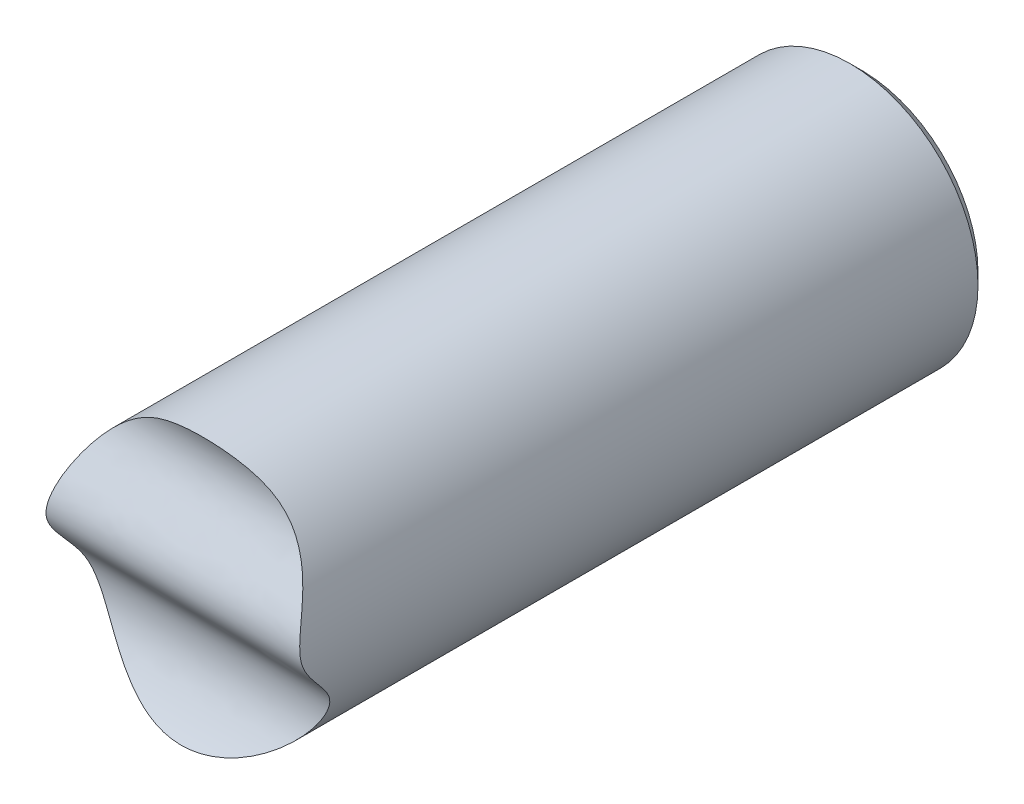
ISO-10303-21;
HEADER;
FILE_DESCRIPTION(('STEP AP214'),'2;1');
FILE_NAME('part.step','',(''),(''),'','','');
FILE_SCHEMA(('AUTOMOTIVE_DESIGN { 1 0 10303 214 1 1 1 1 }'));
ENDSEC;
DATA;
#1=APPLICATION_CONTEXT('core data for automotive mechanical design processes');
#2=APPLICATION_PROTOCOL_DEFINITION('international standard','automotive_design',2000,#1);
#3=PRODUCT_CONTEXT('',#1,'mechanical');
#4=PRODUCT('Part','Part','',(#3));
#5=PRODUCT_RELATED_PRODUCT_CATEGORY('part','',(#4));
#6=PRODUCT_DEFINITION_FORMATION('','',#4);
#7=PRODUCT_DEFINITION_CONTEXT('part definition',#1,'design');
#8=PRODUCT_DEFINITION('design','',#6,#7);
#9=PRODUCT_DEFINITION_SHAPE('','',#8);
#10=(LENGTH_UNIT() NAMED_UNIT(*) SI_UNIT(.MILLI.,.METRE.));
#11=(NAMED_UNIT(*) PLANE_ANGLE_UNIT() SI_UNIT($,.RADIAN.));
#12=(NAMED_UNIT(*) SI_UNIT($,.STERADIAN.) SOLID_ANGLE_UNIT());
#13=UNCERTAINTY_MEASURE_WITH_UNIT(LENGTH_MEASURE(1.E-05),#10,'distance_accuracy_value','');
#14=(GEOMETRIC_REPRESENTATION_CONTEXT(3) GLOBAL_UNCERTAINTY_ASSIGNED_CONTEXT((#13)) GLOBAL_UNIT_ASSIGNED_CONTEXT((#10,
#11,#12)) REPRESENTATION_CONTEXT('',''));
#15=CARTESIAN_POINT('',(0.,0.,0.));
#16=DIRECTION('',(0.,0.,1.));
#17=DIRECTION('',(1.,0.,0.));
#18=AXIS2_PLACEMENT_3D('',#15,#16,#17);
#19=CARTESIAN_POINT('',(2.11065070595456,0.,60.));
#20=DIRECTION('',(0.,0.,-1.));
#21=DIRECTION('',(-1.,0.,0.));
#22=AXIS2_PLACEMENT_3D('',#19,#20,#21);
#23=CYLINDRICAL_SURFACE('',#22,11.);
#24=CARTESIAN_POINT('',(2.11065070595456,0.,0.999999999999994));
#25=DIRECTION('',(0.,0.,1.));
#26=DIRECTION('',(1.,0.,0.));
#27=AXIS2_PLACEMENT_3D('',#24,#25,#26);
#28=CIRCLE('',#27,11.);
#29=CARTESIAN_POINT('',(13.1106507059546,0.,0.999999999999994));
#30=VERTEX_POINT('',#29);
#31=EDGE_CURVE('E54',#30,#30,#28,.T.);
#32=ORIENTED_EDGE('',*,*,#31,.T.);
#33=EDGE_LOOP('',(#32));
#34=FACE_BOUND('',#33,.T.);
#35=CARTESIAN_POINT('',(-8.88934929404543,0.,58.7075749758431));
#36=CARTESIAN_POINT('',(-8.88934900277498,0.0692900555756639,58.7483672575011));
#37=CARTESIAN_POINT('',(-8.88869545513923,0.139679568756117,58.7873014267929));
#38=CARTESIAN_POINT('',(-8.88594414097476,0.282906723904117,58.8605286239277));
#39=CARTESIAN_POINT('',(-8.88384517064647,0.355746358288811,58.8948177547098));
#40=CARTESIAN_POINT('',(-8.87807503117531,0.503304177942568,58.9573739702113));
#41=CARTESIAN_POINT('',(-8.87441548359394,0.578004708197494,58.9856833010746));
#42=CARTESIAN_POINT('',(-8.86539205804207,0.729547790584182,59.0354222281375));
#43=CARTESIAN_POINT('',(-8.86002927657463,0.806388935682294,59.0568562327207));
#44=CARTESIAN_POINT('',(-8.8474369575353,0.962551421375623,59.0918818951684));
#45=CARTESIAN_POINT('',(-8.84018844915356,1.04189031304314,59.1053890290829));
#46=CARTESIAN_POINT('',(-8.82384667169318,1.20133166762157,59.1245583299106));
#47=CARTESIAN_POINT('',(-8.81475255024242,1.28143446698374,59.1302168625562));
#48=CARTESIAN_POINT('',(-8.79472722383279,1.44198121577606,59.1344336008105));
#49=CARTESIAN_POINT('',(-8.78378708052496,1.5224248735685,59.1329562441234));
#50=CARTESIAN_POINT('',(-8.76018498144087,1.68270704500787,59.1236949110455));
#51=CARTESIAN_POINT('',(-8.74752216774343,1.76254523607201,59.1159077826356));
#52=CARTESIAN_POINT('',(-8.71333542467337,1.96382566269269,59.0892992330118));
#53=CARTESIAN_POINT('',(-8.69070404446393,2.08459195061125,59.0667982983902));
#54=CARTESIAN_POINT('',(-8.64192187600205,2.32315311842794,59.0120221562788));
#55=CARTESIAN_POINT('',(-8.61576852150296,2.44094575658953,58.9797398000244));
#56=CARTESIAN_POINT('',(-8.56013488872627,2.67370241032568,58.9077574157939));
#57=CARTESIAN_POINT('',(-8.53064730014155,2.7886595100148,58.8680409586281));
#58=CARTESIAN_POINT('',(-8.46856987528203,3.0156139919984,58.7831598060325));
#59=CARTESIAN_POINT('',(-8.43598090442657,3.12761218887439,58.7379966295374));
#60=CARTESIAN_POINT('',(-8.34895843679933,3.41012145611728,58.6176803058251));
#61=CARTESIAN_POINT('',(-8.29240101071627,3.5787857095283,58.5397400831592));
#62=CARTESIAN_POINT('',(-8.17211067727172,3.91101645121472,58.3784690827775));
#63=CARTESIAN_POINT('',(-8.10837181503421,4.07457856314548,58.2951338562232));
#64=CARTESIAN_POINT('',(-7.97359319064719,4.3975742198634,58.12614656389));
#65=CARTESIAN_POINT('',(-7.90254906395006,4.55700522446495,58.0404931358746));
#66=CARTESIAN_POINT('',(-7.75290726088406,4.8724434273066,57.869405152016));
#67=CARTESIAN_POINT('',(-7.6743083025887,5.02845003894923,57.7839706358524));
#68=CARTESIAN_POINT('',(-7.5092057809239,5.33751039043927,57.6156724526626));
#69=CARTESIAN_POINT('',(-7.42270700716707,5.4905658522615,57.5328072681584));
#70=CARTESIAN_POINT('',(-7.24146387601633,5.79388965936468,57.3711892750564));
#71=CARTESIAN_POINT('',(-7.14672157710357,5.94415868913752,57.2924354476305));
#72=CARTESIAN_POINT('',(-6.92697548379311,6.27445675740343,57.123789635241));
#73=CARTESIAN_POINT('',(-6.79988837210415,6.45379613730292,57.0352355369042));
#74=CARTESIAN_POINT('',(-6.53255613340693,6.80765190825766,56.8688614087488));
#75=CARTESIAN_POINT('',(-6.39231054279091,6.98216812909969,56.7910417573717));
#76=CARTESIAN_POINT('',(-6.09898859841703,7.32478763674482,56.6486376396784));
#77=CARTESIAN_POINT('',(-5.9459522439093,7.4929086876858,56.5840139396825));
#78=CARTESIAN_POINT('',(-5.62700024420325,7.82184053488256,56.4694792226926));
#79=CARTESIAN_POINT('',(-5.46108574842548,7.9826519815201,56.4195668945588));
#80=CARTESIAN_POINT('',(-5.17401332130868,8.24366026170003,56.3492613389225));
#81=CARTESIAN_POINT('',(-5.05614747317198,8.34635200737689,56.324561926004));
#82=CARTESIAN_POINT('',(-4.81537252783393,8.54720844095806,56.2821652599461));
#83=CARTESIAN_POINT('',(-4.6924629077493,8.64537265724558,56.2644687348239));
#84=CARTESIAN_POINT('',(-4.44205765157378,8.83667583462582,56.2358738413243));
#85=CARTESIAN_POINT('',(-4.31456248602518,8.9298153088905,56.2249747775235));
#86=CARTESIAN_POINT('',(-4.05501059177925,9.11096848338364,56.209507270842));
#87=CARTESIAN_POINT('',(-3.92294064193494,9.19896493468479,56.2049590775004));
#88=CARTESIAN_POINT('',(-3.65506139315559,9.36919162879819,56.2016263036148));
#89=CARTESIAN_POINT('',(-3.51925183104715,9.45142146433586,56.2028421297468));
#90=CARTESIAN_POINT('',(-3.24429949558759,9.60987466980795,56.2102368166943));
#91=CARTESIAN_POINT('',(-3.10515638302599,9.68609742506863,56.2164161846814));
#92=CARTESIAN_POINT('',(-2.78402270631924,9.85309915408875,56.235223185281));
#93=CARTESIAN_POINT('',(-2.60106888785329,9.94187802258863,56.2491823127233));
#94=CARTESIAN_POINT('',(-2.23080509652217,10.1090574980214,56.281173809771));
#95=CARTESIAN_POINT('',(-2.04349410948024,10.1874556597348,56.2992071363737));
#96=CARTESIAN_POINT('',(-1.6649332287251,10.3337383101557,56.3369204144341));
#97=CARTESIAN_POINT('',(-1.47368255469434,10.4016206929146,56.3566006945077));
#98=CARTESIAN_POINT('',(-1.08779746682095,10.5266825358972,56.3956436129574));
#99=CARTESIAN_POINT('',(-0.893164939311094,10.5838677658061,56.4150064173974));
#100=CARTESIAN_POINT('',(-0.500898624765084,10.6874198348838,56.4518451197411));
#101=CARTESIAN_POINT('',(-0.303265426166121,10.7337887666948,56.4693213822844));
#102=CARTESIAN_POINT('',(0.0944829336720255,10.815558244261,56.5011705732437));
#103=CARTESIAN_POINT('',(0.294597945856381,10.8509594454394,56.5155436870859));
#104=CARTESIAN_POINT('',(0.79959523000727,10.9259080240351,56.5465756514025));
#105=CARTESIAN_POINT('',(1.10573488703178,10.9583222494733,56.5606463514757));
#106=CARTESIAN_POINT('',(1.71996152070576,10.9973669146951,56.5776769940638));
#107=CARTESIAN_POINT('',(2.0280485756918,11.0039963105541,56.5806364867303));
#108=CARTESIAN_POINT('',(2.6436894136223,10.9913919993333,56.5750849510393));
#109=CARTESIAN_POINT('',(2.9512429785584,10.9721494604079,56.5665700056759));
#110=CARTESIAN_POINT('',(3.56318522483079,10.9080143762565,56.5391370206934));
#111=CARTESIAN_POINT('',(3.86757407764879,10.8631232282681,56.520219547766));
#112=CARTESIAN_POINT('',(4.35638318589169,10.7700059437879,56.4832859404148));
#113=CARTESIAN_POINT('',(4.54250293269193,10.72950744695,56.4676510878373));
#114=CARTESIAN_POINT('',(4.91222665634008,10.6389559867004,56.4343525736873));
#115=CARTESIAN_POINT('',(5.09583067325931,10.5889031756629,56.4166889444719));
#116=CARTESIAN_POINT('',(5.46015032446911,10.4793628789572,56.3805163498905));
#117=CARTESIAN_POINT('',(5.64086541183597,10.4198736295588,56.3620072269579));
#118=CARTESIAN_POINT('',(5.9989537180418,10.2916109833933,56.3256365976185));
#119=CARTESIAN_POINT('',(6.17632824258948,10.2228413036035,56.3077748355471));
#120=CARTESIAN_POINT('',(6.52745283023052,10.0761128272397,56.2744815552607));
#121=CARTESIAN_POINT('',(6.7012035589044,9.99815573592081,56.2590495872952));
#122=CARTESIAN_POINT('',(6.95879937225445,9.87443812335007,56.2393486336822));
#123=CARTESIAN_POINT('',(7.04415498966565,9.83207110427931,56.233356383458));
#124=CARTESIAN_POINT('',(7.21380536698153,9.74509613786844,56.2228075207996));
#125=CARTESIAN_POINT('',(7.29810015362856,9.70048824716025,56.2182508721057));
#126=CARTESIAN_POINT('',(7.51519066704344,9.58196371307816,56.2085471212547));
#127=CARTESIAN_POINT('',(7.64712179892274,9.50634572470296,56.2046506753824));
#128=CARTESIAN_POINT('',(7.90777127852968,9.34967983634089,56.2017459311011));
#129=CARTESIAN_POINT('',(8.03648975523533,9.26863215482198,56.2027374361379));
#130=CARTESIAN_POINT('',(8.29034281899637,9.10134648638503,56.2102503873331));
#131=CARTESIAN_POINT('',(8.4154775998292,9.01510878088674,56.216771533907));
#132=CARTESIAN_POINT('',(8.66145528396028,8.83797889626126,56.235819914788));
#133=CARTESIAN_POINT('',(8.78230834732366,8.74709918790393,56.2483317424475));
#134=CARTESIAN_POINT('',(9.01967551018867,8.56084882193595,56.2796824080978));
#135=CARTESIAN_POINT('',(9.13618930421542,8.46547784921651,56.2985216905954));
#136=CARTESIAN_POINT('',(9.36448724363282,8.27069392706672,56.342652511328));
#137=CARTESIAN_POINT('',(9.47627190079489,8.17128141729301,56.3679433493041));
#138=CARTESIAN_POINT('',(9.74918933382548,7.91848708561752,56.439114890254));
#139=CARTESIAN_POINT('',(9.90722077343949,7.76284958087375,56.4889805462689));
#140=CARTESIAN_POINT('',(10.211331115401,7.44495852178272,56.6021747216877));
#141=CARTESIAN_POINT('',(10.3574080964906,7.28270391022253,56.6655053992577));
#142=CARTESIAN_POINT('',(10.6380253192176,6.95205975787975,56.8043363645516));
#143=CARTESIAN_POINT('',(10.7725067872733,6.7836444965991,56.879893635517));
#144=CARTESIAN_POINT('',(11.029225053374,6.4424080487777,57.040873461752));
#145=CARTESIAN_POINT('',(11.1514659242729,6.26958835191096,57.1262927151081));
#146=CARTESIAN_POINT('',(11.3605139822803,5.9555044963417,57.2866287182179));
#147=CARTESIAN_POINT('',(11.4494775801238,5.8149541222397,57.3601587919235));
#148=CARTESIAN_POINT('',(11.6201778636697,5.53139111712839,57.5109007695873));
#149=CARTESIAN_POINT('',(11.7019121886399,5.38837769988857,57.5881138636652));
#150=CARTESIAN_POINT('',(11.8584858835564,5.09967933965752,57.7450826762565));
#151=CARTESIAN_POINT('',(11.9333152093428,4.95399086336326,57.8248418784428));
#152=CARTESIAN_POINT('',(12.0764408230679,4.65938855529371,57.9851332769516));
#153=CARTESIAN_POINT('',(12.1447230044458,4.51046857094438,58.0656667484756));
#154=CARTESIAN_POINT('',(12.2744629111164,4.20993637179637,58.2248856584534));
#155=CARTESIAN_POINT('',(12.3359567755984,4.05834394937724,58.3035789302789));
#156=CARTESIAN_POINT('',(12.4526370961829,3.7510402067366,58.4571584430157));
#157=CARTESIAN_POINT('',(12.5078297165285,3.59533309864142,58.53204836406));
#158=CARTESIAN_POINT('',(12.6117979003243,3.27925503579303,58.6748722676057));
#159=CARTESIAN_POINT('',(12.6605924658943,3.11889970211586,58.7428267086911));
#160=CARTESIAN_POINT('',(12.751644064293,2.79246808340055,58.8678390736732));
#161=CARTESIAN_POINT('',(12.7939158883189,2.62640581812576,58.9249217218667));
#162=CARTESIAN_POINT('',(12.8523561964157,2.37139169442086,58.9983868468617));
#163=CARTESIAN_POINT('',(12.8711139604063,2.28481648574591,59.0209550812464));
#164=CARTESIAN_POINT('',(12.9067498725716,2.11002328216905,59.0608186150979));
#165=CARTESIAN_POINT('',(12.9236274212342,2.02180477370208,59.0781122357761));
#166=CARTESIAN_POINT('',(12.9552893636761,1.84442033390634,59.1061974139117));
#167=CARTESIAN_POINT('',(12.9700840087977,1.75526154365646,59.1170217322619));
#168=CARTESIAN_POINT('',(12.9975435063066,1.57599963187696,59.1310436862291));
#169=CARTESIAN_POINT('',(13.0102089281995,1.48589676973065,59.1342433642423));
#170=CARTESIAN_POINT('',(13.0309119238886,1.32405434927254,59.1320187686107));
#171=CARTESIAN_POINT('',(13.0393656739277,1.25234563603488,59.1282313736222));
#172=CARTESIAN_POINT('',(13.0548032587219,1.10936273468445,59.1145113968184));
#173=CARTESIAN_POINT('',(13.0617877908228,1.03808835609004,59.10458173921));
#174=CARTESIAN_POINT('',(13.0711547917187,0.931995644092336,59.0847872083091));
#175=CARTESIAN_POINT('',(13.074092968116,0.896756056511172,59.0773690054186));
#176=CARTESIAN_POINT('',(13.0796034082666,0.826627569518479,59.0609136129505));
#177=CARTESIAN_POINT('',(13.0821756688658,0.791738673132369,59.0518764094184));
#178=CARTESIAN_POINT('',(13.0893556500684,0.687658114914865,59.0224943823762));
#179=CARTESIAN_POINT('',(13.0934256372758,0.619063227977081,58.9998811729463));
#180=CARTESIAN_POINT('',(13.1016551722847,0.455108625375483,58.9387831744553));
#181=CARTESIAN_POINT('',(13.1051228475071,0.360715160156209,58.8976323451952));
#182=CARTESIAN_POINT('',(13.1096344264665,0.17584728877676,58.8072128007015));
#183=CARTESIAN_POINT('',(13.1106766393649,0.0853756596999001,58.7579384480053));
#184=CARTESIAN_POINT('',(13.1106236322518,-0.0924800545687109,58.653024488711));
#185=CARTESIAN_POINT('',(13.1095156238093,-0.179842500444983,58.5973486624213));
#186=CARTESIAN_POINT('',(13.1053699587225,-0.351434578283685,58.4815480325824));
#187=CARTESIAN_POINT('',(13.1023330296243,-0.435665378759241,58.4214249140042));
#188=CARTESIAN_POINT('',(13.0926600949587,-0.640630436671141,58.2690466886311));
#189=CARTESIAN_POINT('',(13.0850038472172,-0.759941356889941,58.1749555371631));
#190=CARTESIAN_POINT('',(13.0661681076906,-0.995273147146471,57.9829950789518));
#191=CARTESIAN_POINT('',(13.0549861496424,-1.11129165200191,57.8851231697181));
#192=CARTESIAN_POINT('',(13.0291159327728,-1.34185874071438,57.6879325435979));
#193=CARTESIAN_POINT('',(13.0144246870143,-1.45640598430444,57.5886126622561));
#194=CARTESIAN_POINT('',(12.9814012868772,-1.68526239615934,57.3909446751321));
#195=CARTESIAN_POINT('',(12.963079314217,-1.79957134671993,57.2925946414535));
#196=CARTESIAN_POINT('',(12.9224024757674,-2.02969601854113,57.0986935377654));
#197=CARTESIAN_POINT('',(12.9000508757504,-2.14551044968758,57.0031402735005));
#198=CARTESIAN_POINT('',(12.8507347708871,-2.3801175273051,56.8170309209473));
#199=CARTESIAN_POINT('',(12.8237724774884,-2.49890872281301,56.7264724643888));
#200=CARTESIAN_POINT('',(12.7776541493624,-2.68696935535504,56.5916106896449));
#201=CARTESIAN_POINT('',(12.7603557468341,-2.75477938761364,56.5446401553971));
#202=CARTESIAN_POINT('',(12.7239484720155,-2.8918755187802,56.4536311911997));
#203=CARTESIAN_POINT('',(12.7048396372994,-2.96116158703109,56.4095927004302));
#204=CARTESIAN_POINT('',(12.6646643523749,-3.10130719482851,56.3250723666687));
#205=CARTESIAN_POINT('',(12.6435983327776,-3.17216638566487,56.2845897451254));
#206=CARTESIAN_POINT('',(12.5994397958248,-3.31525108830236,56.2079799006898));
#207=CARTESIAN_POINT('',(12.5763548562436,-3.38747075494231,56.1718375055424));
#208=CARTESIAN_POINT('',(12.5279723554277,-3.53345645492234,56.1044447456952));
#209=CARTESIAN_POINT('',(12.502674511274,-3.60722268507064,56.0731950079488));
#210=CARTESIAN_POINT('',(12.4498816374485,-3.75586613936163,56.0156251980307));
#211=CARTESIAN_POINT('',(12.4223867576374,-3.83074328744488,55.989304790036));
#212=CARTESIAN_POINT('',(12.3508201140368,-4.01914913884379,55.9294750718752));
#213=CARTESIAN_POINT('',(12.3053766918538,-4.133141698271,55.8990265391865));
#214=CARTESIAN_POINT('',(12.2098116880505,-4.36145374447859,55.848552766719));
#215=CARTESIAN_POINT('',(12.1596892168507,-4.4757732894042,55.8285295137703));
#216=CARTESIAN_POINT('',(12.0548276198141,-4.7041688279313,55.7979717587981));
#217=CARTESIAN_POINT('',(12.0000687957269,-4.81824142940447,55.7874802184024));
#218=CARTESIAN_POINT('',(11.8864545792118,-5.04477256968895,55.7751174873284));
#219=CARTESIAN_POINT('',(11.8275989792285,-5.15723102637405,55.7732467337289));
#220=CARTESIAN_POINT('',(11.6763786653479,-5.43437978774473,55.7779961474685));
#221=CARTESIAN_POINT('',(11.5816965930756,-5.59773232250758,55.7892135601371));
#222=CARTESIAN_POINT('',(11.3847723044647,-5.91828678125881,55.8250934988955));
#223=CARTESIAN_POINT('',(11.2825259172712,-6.07548523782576,55.8497634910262));
#224=CARTESIAN_POINT('',(11.0710939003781,-6.38320768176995,55.9097065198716));
#225=CARTESIAN_POINT('',(10.9619020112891,-6.53372543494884,55.9449892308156));
#226=CARTESIAN_POINT('',(10.7371900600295,-6.8276679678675,56.0237476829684));
#227=CARTESIAN_POINT('',(10.6216704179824,-6.97109321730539,56.0672228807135));
#228=CARTESIAN_POINT('',(10.4045555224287,-7.2273382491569,56.1525769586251));
#229=CARTESIAN_POINT('',(10.3038739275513,-7.34125698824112,56.1935008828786));
#230=CARTESIAN_POINT('',(10.0985405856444,-7.56416413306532,56.2787067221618));
#231=CARTESIAN_POINT('',(9.99388832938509,-7.67315190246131,56.3229890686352));
#232=CARTESIAN_POINT('',(9.67408263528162,-7.99283566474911,56.4596409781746));
#233=CARTESIAN_POINT('',(9.45313919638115,-8.19618277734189,56.5557912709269));
#234=CARTESIAN_POINT('',(8.99618893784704,-8.58366394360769,56.7527309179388));
#235=CARTESIAN_POINT('',(8.76015244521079,-8.76775814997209,56.8535292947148));
#236=CARTESIAN_POINT('',(8.27398111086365,-9.11607064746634,57.0552971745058));
#237=CARTESIAN_POINT('',(8.02384913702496,-9.28029296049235,57.1562666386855));
#238=CARTESIAN_POINT('',(7.49936716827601,-9.59474007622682,57.358672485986));
#239=CARTESIAN_POINT('',(7.22444395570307,-9.74410927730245,57.4599566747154));
#240=CARTESIAN_POINT('',(6.66043513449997,-10.0198798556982,57.6543948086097));
#241=CARTESIAN_POINT('',(6.37134696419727,-10.1462770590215,57.7475472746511));
#242=CARTESIAN_POINT('',(5.78090492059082,-10.3744447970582,57.9210965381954));
#243=CARTESIAN_POINT('',(5.4795894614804,-10.4762863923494,58.0015299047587));
#244=CARTESIAN_POINT('',(4.86555791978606,-10.6542249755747,58.1454785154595));
#245=CARTESIAN_POINT('',(4.55284768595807,-10.7303349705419,58.2090023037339));
#246=CARTESIAN_POINT('',(4.00569004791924,-10.8380732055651,58.3003723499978));
#247=CARTESIAN_POINT('',(3.77333620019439,-10.8761771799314,58.3332256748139));
#248=CARTESIAN_POINT('',(3.30526243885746,-10.9374848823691,58.3864882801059));
#249=CARTESIAN_POINT('',(3.06954312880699,-10.9606912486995,58.4068997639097));
#250=CARTESIAN_POINT('',(2.59650902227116,-10.9918187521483,58.4343500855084));
#251=CARTESIAN_POINT('',(2.35919569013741,-10.9997523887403,58.4413998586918));
#252=CARTESIAN_POINT('',(1.88453014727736,-11.0002361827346,58.4418286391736));
#253=CARTESIAN_POINT('',(1.64717793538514,-10.9927857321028,58.4352071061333));
#254=CARTESIAN_POINT('',(1.17455242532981,-10.9626509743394,58.4086241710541));
#255=CARTESIAN_POINT('',(0.939276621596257,-10.9399886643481,58.3886820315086));
#256=CARTESIAN_POINT('',(0.472051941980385,-10.8798200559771,58.3363739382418));
#257=CARTESIAN_POINT('',(0.240103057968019,-10.8423137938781,58.3040080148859));
#258=CARTESIAN_POINT('',(-0.219341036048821,-10.7529511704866,58.2281472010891));
#259=CARTESIAN_POINT('',(-0.446832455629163,-10.7010831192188,58.1846432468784));
#260=CARTESIAN_POINT('',(-0.896267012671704,-10.583593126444,58.0880767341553));
#261=CARTESIAN_POINT('',(-1.11820690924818,-10.5179633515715,58.0350087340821));
#262=CARTESIAN_POINT('',(-1.63130203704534,-10.3486159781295,57.9012987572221));
#263=CARTESIAN_POINT('',(-1.91987792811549,-10.2395732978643,57.8174647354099));
#264=CARTESIAN_POINT('',(-2.48427805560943,-9.99904040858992,57.6396147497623));
#265=CARTESIAN_POINT('',(-2.76009787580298,-9.86754249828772,57.545595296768));
#266=CARTESIAN_POINT('',(-3.29905379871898,-9.58270905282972,57.3510056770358));
#267=CARTESIAN_POINT('',(-3.56214461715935,-9.42930227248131,57.2504147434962));
#268=CARTESIAN_POINT('',(-4.07405459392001,-9.1017440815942,57.0468875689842));
#269=CARTESIAN_POINT('',(-4.32287645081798,-8.92759661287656,56.9439517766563));
#270=CARTESIAN_POINT('',(-4.72868026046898,-8.61779111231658,56.7724134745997));
#271=CARTESIAN_POINT('',(-4.88964227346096,-8.48757258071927,56.7033318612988));
#272=CARTESIAN_POINT('',(-5.20455498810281,-8.2177109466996,56.5674705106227));
#273=CARTESIAN_POINT('',(-5.35850462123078,-8.07806641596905,56.5006911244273));
#274=CARTESIAN_POINT('',(-5.65925447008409,-7.78922809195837,56.3712068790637));
#275=CARTESIAN_POINT('',(-5.8060490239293,-7.64002694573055,56.3085052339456));
#276=CARTESIAN_POINT('',(-6.09135802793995,-7.33285649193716,56.1896494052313));
#277=CARTESIAN_POINT('',(-6.22990889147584,-7.17493278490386,56.1334651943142));
#278=CARTESIAN_POINT('',(-6.498964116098,-6.84974500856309,56.029894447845));
#279=CARTESIAN_POINT('',(-6.62947387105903,-6.68248734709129,55.9825019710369));
#280=CARTESIAN_POINT('',(-6.88170206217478,-6.33900439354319,55.899714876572));
#281=CARTESIAN_POINT('',(-7.0034329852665,-6.16279247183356,55.8643029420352));
#282=CARTESIAN_POINT('',(-7.26505463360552,-5.75904329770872,55.8028266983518));
#283=CARTESIAN_POINT('',(-7.40248541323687,-5.5291798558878,55.7809179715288));
#284=CARTESIAN_POINT('',(-7.59578208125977,-5.17717349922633,55.7730428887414));
#285=CARTESIAN_POINT('',(-7.65802331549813,-5.05874414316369,55.7745701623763));
#286=CARTESIAN_POINT('',(-7.77798756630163,-4.82002467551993,55.787181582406));
#287=CARTESIAN_POINT('',(-7.83570978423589,-4.69973423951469,55.7982674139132));
#288=CARTESIAN_POINT('',(-7.9283827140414,-4.49732221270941,55.8258711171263));
#289=CARTESIAN_POINT('',(-7.96467153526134,-4.41540820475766,55.8394822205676));
#290=CARTESIAN_POINT('',(-8.03488223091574,-4.25159911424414,55.871958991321));
#291=CARTESIAN_POINT('',(-8.06880423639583,-4.1697040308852,55.8908243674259));
#292=CARTESIAN_POINT('',(-8.13417273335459,-4.00641073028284,55.9340615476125));
#293=CARTESIAN_POINT('',(-8.16562002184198,-3.9250123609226,55.9584315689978));
#294=CARTESIAN_POINT('',(-8.22595448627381,-3.76324793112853,56.0128296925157));
#295=CARTESIAN_POINT('',(-8.2548441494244,-3.68288093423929,56.0428522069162));
#296=CARTESIAN_POINT('',(-8.29625186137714,-3.56344741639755,56.0921662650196));
#297=CARTESIAN_POINT('',(-8.30973423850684,-3.52381948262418,56.1093191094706));
#298=CARTESIAN_POINT('',(-8.33605790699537,-3.4449972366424,56.1450546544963));
#299=CARTESIAN_POINT('',(-8.3488992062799,-3.40580291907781,56.1636373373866));
#300=CARTESIAN_POINT('',(-8.38645798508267,-3.28898040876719,56.2213520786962));
#301=CARTESIAN_POINT('',(-8.41023686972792,-3.21203590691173,56.2624827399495));
#302=CARTESIAN_POINT('',(-8.48787556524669,-2.95103136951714,56.4113496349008));
#303=CARTESIAN_POINT('',(-8.5360022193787,-2.77150760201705,56.5300575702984));
#304=CARTESIAN_POINT('',(-8.59984206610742,-2.50868334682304,56.7200294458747));
#305=CARTESIAN_POINT('',(-8.61976832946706,-2.42195024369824,56.7855113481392));
#306=CARTESIAN_POINT('',(-8.65709073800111,-2.25021156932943,56.9194048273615));
#307=CARTESIAN_POINT('',(-8.6744872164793,-2.16520577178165,56.9878160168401));
#308=CARTESIAN_POINT('',(-8.72342830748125,-1.91120594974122,57.1966941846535));
#309=CARTESIAN_POINT('',(-8.75152626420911,-1.744056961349,57.3401823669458));
#310=CARTESIAN_POINT('',(-8.78789520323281,-1.49293243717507,57.5570547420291));
#311=CARTESIAN_POINT('',(-8.79908452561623,-1.40885798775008,57.6298805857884));
#312=CARTESIAN_POINT('',(-8.81955243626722,-1.24012140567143,57.7751173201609));
#313=CARTESIAN_POINT('',(-8.82883115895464,-1.15545931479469,57.8475282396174));
#314=CARTESIAN_POINT('',(-8.84546488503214,-0.98529108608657,57.9906981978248));
#315=CARTESIAN_POINT('',(-8.8528293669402,-0.899791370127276,58.0614637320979));
#316=CARTESIAN_POINT('',(-8.86565597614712,-0.726786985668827,58.2007378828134));
#317=CARTESIAN_POINT('',(-8.87111770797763,-0.639281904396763,58.2692460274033));
#318=CARTESIAN_POINT('',(-8.88000537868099,-0.461881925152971,58.4024896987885));
#319=CARTESIAN_POINT('',(-8.88343954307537,-0.371998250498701,58.4672394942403));
#320=CARTESIAN_POINT('',(-8.88811103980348,-0.188770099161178,58.5916906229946));
#321=CARTESIAN_POINT('',(-8.88934969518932,-0.0954277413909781,58.6513949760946));
#322=CARTESIAN_POINT('',(-8.88934929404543,0.,58.7075749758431));
#323=B_SPLINE_CURVE_WITH_KNOTS('',3,(#35,#36,#37,#38,#39,#40,#41,#42,#43,#44,#45,#46,#47,#48,
#49,#50,#51,#52,#53,#54,#55,#56,#57,#58,#59,#60,#61,#62,#63,#64,#65,#66,#67,#68,#69,#70,#71,#72,
#73,#74,#75,#76,#77,#78,#79,#80,#81,#82,#83,#84,#85,#86,#87,#88,#89,#90,#91,#92,#93,#94,#95,#96,
#97,#98,#99,#100,#101,#102,#103,#104,#105,#106,#107,#108,#109,#110,#111,#112,#113,#114,#115,
#116,#117,#118,#119,#120,#121,#122,#123,#124,#125,#126,#127,#128,#129,#130,#131,#132,#133,#134,
#135,#136,#137,#138,#139,#140,#141,#142,#143,#144,#145,#146,#147,#148,#149,#150,#151,#152,#153,
#154,#155,#156,#157,#158,#159,#160,#161,#162,#163,#164,#165,#166,#167,#168,#169,#170,#171,#172,
#173,#174,#175,#176,#177,#178,#179,#180,#181,#182,#183,#184,#185,#186,#187,#188,#189,#190,#191,
#192,#193,#194,#195,#196,#197,#198,#199,#200,#201,#202,#203,#204,#205,#206,#207,#208,#209,#210,
#211,#212,#213,#214,#215,#216,#217,#218,#219,#220,#221,#222,#223,#224,#225,#226,#227,#228,#229,
#230,#231,#232,#233,#234,#235,#236,#237,#238,#239,#240,#241,#242,#243,#244,#245,#246,#247,#248,
#249,#250,#251,#252,#253,#254,#255,#256,#257,#258,#259,#260,#261,#262,#263,#264,#265,#266,#267,
#268,#269,#270,#271,#272,#273,#274,#275,#276,#277,#278,#279,#280,#281,#282,#283,#284,#285,#286,
#287,#288,#289,#290,#291,#292,#293,#294,#295,#296,#297,#298,#299,#300,#301,#302,#303,#304,#305,
#306,#307,#308,#309,#310,#311,#312,#313,#314,#315,#316,#317,#318,#319,#320,#321,#322),
.UNSPECIFIED.,.T.,.F.,(4,2,2,2,2,2,2,2,2,2,2,2,2,2,2,2,2,2,2,2,2,2,2,2,2,2,2,2,2,2,2,2,2,2,2,2,
2,2,2,2,2,2,2,2,2,2,2,2,2,2,2,2,2,2,2,2,2,2,2,2,2,2,2,2,2,2,2,2,2,2,2,2,2,2,2,2,2,2,2,2,2,2,2,2,
2,2,2,2,2,2,2,2,2,2,2,2,2,2,2,2,2,2,2,2,2,2,2,2,2,2,2,2,2,2,2,2,2,2,2,2,2,2,2,2,2,2,2,2,2,2,2,2,
2,2,2,2,2,2,2,2,2,2,2,4),(0.,0.24117992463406,0.482560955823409,0.722174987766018,
0.961635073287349,1.20360418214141,1.44568529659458,1.68897408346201,1.93238447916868,
2.30647570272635,2.68084099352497,3.05604360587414,3.43114182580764,4.01340722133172,
4.59615903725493,5.17926106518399,5.76246221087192,6.34531208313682,6.92801682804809,
7.63833468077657,8.34867756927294,9.05687671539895,9.76501272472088,10.2395331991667,
10.7141029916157,11.1886242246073,11.6646550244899,12.1407194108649,12.61683244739,
13.2279334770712,13.8391781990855,14.4505451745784,15.0615814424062,15.6724993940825,
16.2833808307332,17.2065723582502,18.1298012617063,19.0533454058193,19.9768392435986,
20.549946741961,21.1230451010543,21.6962507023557,22.2692274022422,22.8420979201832,
23.1285017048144,23.4148982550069,23.8710359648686,24.3271553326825,24.7832499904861,
25.2381779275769,25.6931378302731,26.1480483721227,26.8291638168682,27.5103885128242,
28.1948847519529,28.8791524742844,29.4245522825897,29.970129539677,30.5164882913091,
31.0639989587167,31.6084378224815,32.1523394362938,32.6945872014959,33.235586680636,
33.5096811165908,33.7838626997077,34.0566437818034,34.3293517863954,34.5460265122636,
34.762598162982,34.870957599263,34.9793179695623,35.1960712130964,35.5046091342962,
35.8133620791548,36.1239569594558,36.4344347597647,36.8906431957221,37.347171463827,
37.8040897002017,38.2597442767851,38.7150312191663,39.1701003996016,39.4228829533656,
39.6756602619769,39.9283820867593,40.1801930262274,40.4320362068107,40.6838622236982,
41.0625848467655,41.4413796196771,41.821873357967,42.202386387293,42.7688909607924,
43.3357102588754,43.9030478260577,44.4703477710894,44.9425118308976,45.4147366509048,
46.3594677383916,47.3061169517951,48.2525742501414,49.238030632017,50.2236658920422,
51.2064136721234,52.1886639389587,52.9011403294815,53.613490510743,54.3252574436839,
55.0370525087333,55.7478204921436,56.4585867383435,57.1699332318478,57.8816857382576,
58.8393505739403,59.7973445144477,60.7585278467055,61.719528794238,62.3740206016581,
63.0286118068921,63.6837128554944,64.3356645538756,64.9871740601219,65.6377377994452,
66.4412657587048,66.8423206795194,67.243446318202,67.5151471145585,67.7868328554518,
68.0584307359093,68.3297615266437,68.4654472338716,68.6011312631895,68.8722381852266,
69.5319085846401,69.8633512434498,70.1947501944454,70.8607061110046,71.1960757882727,
71.531421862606,71.8650743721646,72.1987961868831,72.5311546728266,72.8633128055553),.UNSPECIFIED.);
#324=CARTESIAN_POINT('',(-8.88934929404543,0.,58.7075749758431));
#325=VERTEX_POINT('',#324);
#326=EDGE_CURVE('E11',#325,#325,#323,.T.);
#327=ORIENTED_EDGE('',*,*,#326,.T.);
#328=EDGE_LOOP('',(#327));
#329=FACE_BOUND('',#328,.T.);
#330=ADVANCED_FACE('F29',(#34,#329),#23,.T.);
#331=CARTESIAN_POINT('',(2.11065070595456,0.,0.));
#332=DIRECTION('',(0.,0.,1.));
#333=DIRECTION('',(1.,0.,0.));
#334=AXIS2_PLACEMENT_3D('',#331,#332,#333);
#335=PLANE('',#334);
#336=CARTESIAN_POINT('',(2.11065070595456,0.,0.));
#337=DIRECTION('',(0.,0.,-1.));
#338=DIRECTION('',(-1.,0.,0.));
#339=AXIS2_PLACEMENT_3D('',#336,#337,#338);
#340=CIRCLE('',#339,5.4);
#341=CARTESIAN_POINT('',(-3.28934929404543,0.,0.));
#342=VERTEX_POINT('',#341);
#343=EDGE_CURVE('E51',#342,#342,#340,.T.);
#344=ORIENTED_EDGE('',*,*,#343,.F.);
#345=EDGE_LOOP('',(#344));
#346=FACE_BOUND('',#345,.T.);
#347=CARTESIAN_POINT('',(2.11065070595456,0.,0.));
#348=DIRECTION('',(0.,0.,1.));
#349=DIRECTION('',(1.,0.,0.));
#350=AXIS2_PLACEMENT_3D('',#347,#348,#349);
#351=CIRCLE('',#350,10.);
#352=CARTESIAN_POINT('',(12.1106507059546,0.,0.));
#353=VERTEX_POINT('',#352);
#354=EDGE_CURVE('E39',#353,#353,#351,.F.);
#355=ORIENTED_EDGE('',*,*,#354,.T.);
#356=EDGE_LOOP('',(#355));
#357=FACE_BOUND('',#356,.T.);
#358=ADVANCED_FACE('F72',(#346,#357),#335,.F.);
#359=CARTESIAN_POINT('',(2.11065070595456,0.,0.999999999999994));
#360=DIRECTION('',(0.,0.,1.));
#361=DIRECTION('',(1.,0.,0.));
#362=AXIS2_PLACEMENT_3D('',#359,#360,#361);
#363=CONICAL_SURFACE('',#362,11.,0.78539816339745);
#364=ORIENTED_EDGE('',*,*,#354,.F.);
#365=EDGE_LOOP('',(#364));
#366=FACE_BOUND('',#365,.T.);
#367=ORIENTED_EDGE('',*,*,#31,.F.);
#368=EDGE_LOOP('',(#367));
#369=FACE_BOUND('',#368,.T.);
#370=ADVANCED_FACE('F69',(#366,#369),#363,.T.);
#371=CARTESIAN_POINT('',(-8.88934929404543,15.7012110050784,60.2165299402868));
#372=CARTESIAN_POINT('',(-8.88934929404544,19.8060474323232,66.6467965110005));
#373=CARTESIAN_POINT('',(-8.88934929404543,-22.4342983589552,69.940115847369));
#374=CARTESIAN_POINT('',(-8.88934929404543,-9.40941094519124,56.3599824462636));
#375=CARTESIAN_POINT('',(-8.88934929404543,-3.1033323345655,55.0501629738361));
#376=CARTESIAN_POINT('',(-8.88934929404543,0.477729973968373,60.3918696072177));
#377=CARTESIAN_POINT('',(-8.88934929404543,5.35294107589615,57.5418206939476));
#378=CARTESIAN_POINT('',(-8.88934929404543,9.47780234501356,55.4840316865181));
#379=CARTESIAN_POINT('',(-8.88934929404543,12.9966846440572,57.7040942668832));
#380=CARTESIAN_POINT('',(-8.88934929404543,15.1816499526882,59.4026324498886));
#381=CARTESIAN_POINT('',(-8.88934929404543,15.7012110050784,60.2165299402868));
#382=B_SPLINE_CURVE_WITH_KNOTS('',3,(#371,#372,#373,#374,#375,#376,#377,#378,#379,#380,#381),
.UNSPECIFIED.,.T.,.F.,(4,1,1,1,1,1,1,1,4),(0.,0.460158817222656,0.576646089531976,
0.656408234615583,0.73935881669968,0.811711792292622,0.88691391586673,0.94175636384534,1.),.UNSPECIFIED.);
#383=DIRECTION('',(1.,0.,0.));
#384=VECTOR('',#383,1.);
#385=SURFACE_OF_LINEAR_EXTRUSION('',#382,#384);
#386=ORIENTED_EDGE('',*,*,#326,.F.);
#387=EDGE_LOOP('',(#386));
#388=FACE_BOUND('',#387,.T.);
#389=ADVANCED_FACE('F64',(#388),#385,.F.);
#390=CARTESIAN_POINT('',(2.11065070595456,0.,0.));
#391=DIRECTION('',(0.,0.,-1.));
#392=DIRECTION('',(-1.,0.,0.));
#393=AXIS2_PLACEMENT_3D('',#390,#391,#392);
#394=CYLINDRICAL_SURFACE('',#393,5.4);
#395=CARTESIAN_POINT('',(2.11065070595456,0.,23.75));
#396=DIRECTION('',(0.,0.,-1.));
#397=DIRECTION('',(-1.,0.,0.));
#398=AXIS2_PLACEMENT_3D('',#395,#396,#397);
#399=CIRCLE('',#398,5.39999999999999);
#400=CARTESIAN_POINT('',(-3.28934929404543,0.,23.75));
#401=VERTEX_POINT('',#400);
#402=EDGE_CURVE('E49',#401,#401,#399,.T.);
#403=ORIENTED_EDGE('',*,*,#402,.F.);
#404=EDGE_LOOP('',(#403));
#405=FACE_BOUND('',#404,.T.);
#406=ORIENTED_EDGE('',*,*,#343,.T.);
#407=EDGE_LOOP('',(#406));
#408=FACE_BOUND('',#407,.T.);
#409=ADVANCED_FACE('F45',(#405,#408),#394,.F.);
#410=CARTESIAN_POINT('',(2.11065070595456,0.,23.75));
#411=DIRECTION('',(0.,0.,-1.));
#412=DIRECTION('',(-1.,0.,0.));
#413=AXIS2_PLACEMENT_3D('',#410,#411,#412);
#414=CONICAL_SURFACE('',#413,5.39999999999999,1.02974425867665);
#415=CARTESIAN_POINT('',(2.11065070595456,0.,26.9946473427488));
#416=VERTEX_POINT('',#415);
#417=VERTEX_LOOP('',#416);
#418=FACE_BOUND('',#417,.T.);
#419=ORIENTED_EDGE('',*,*,#402,.T.);
#420=EDGE_LOOP('',(#419));
#421=FACE_BOUND('',#420,.T.);
#422=ADVANCED_FACE('F42',(#418,#421),#414,.F.);
#423=CLOSED_SHELL('',(#330,#358,#370,#389,#409,#422));
#424=MANIFOLD_SOLID_BREP('B2',#423);
#425=ADVANCED_BREP_SHAPE_REPRESENTATION('',(#18,#424),#14);
#426=SHAPE_DEFINITION_REPRESENTATION(#9,#425);
ENDSEC;
END-ISO-10303-21;
